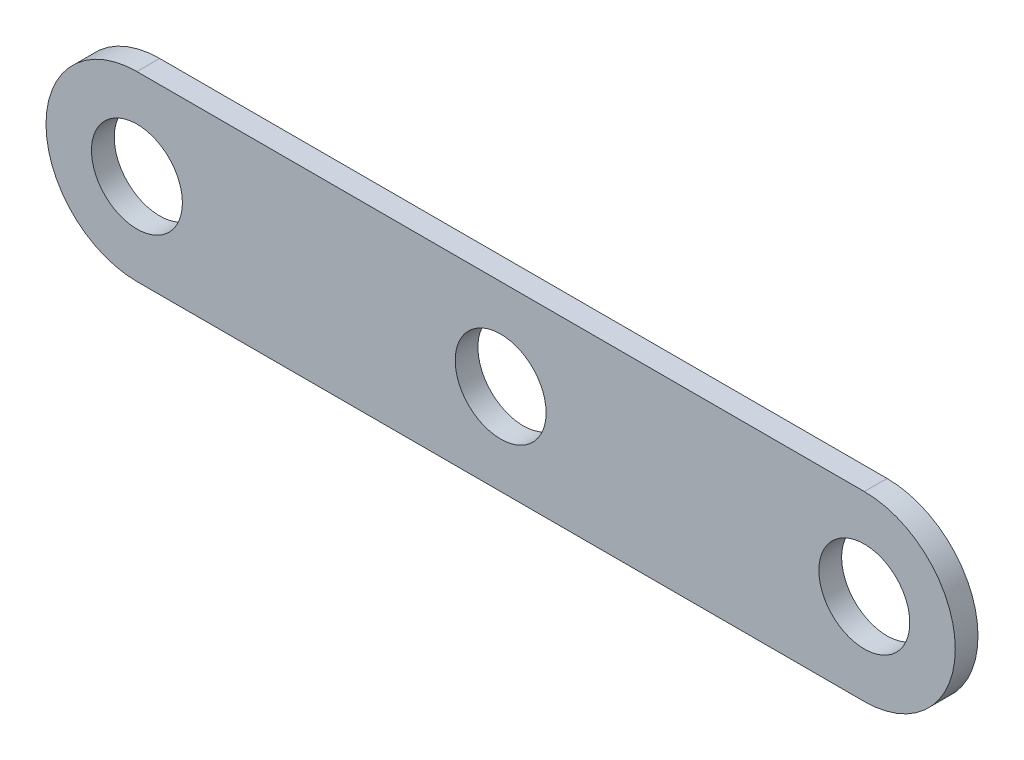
from build123d import *

# Parameters (mm, degrees)
SKETCH1_R           = 50
BOSS_EXTRUDE1_DEPTH = 25


with BuildPart() as part:
    # Sketch1 → Boss-Extrude1 (new body)
    with BuildSketch(Plane.XY):
        with BuildLine():
            Line((-400, 100), (400, 100))
            ThreePointArc((400, 100), (500, 0), (400, -100))
            Line((400, -100), (-400, -100))
            ThreePointArc((-400, -100), (-500, 0), (-400, 100))
        make_face()
        with Locations((-400, 0)):
            Circle(SKETCH1_R, mode=Mode.SUBTRACT)
        with Locations(Location((400, 0, 0), (0, 0, 180))):
            Circle(SKETCH1_R, mode=Mode.SUBTRACT)
        Circle(SKETCH1_R, mode=Mode.SUBTRACT)
    extrude(amount=BOSS_EXTRUDE1_DEPTH)


solid = part.part
